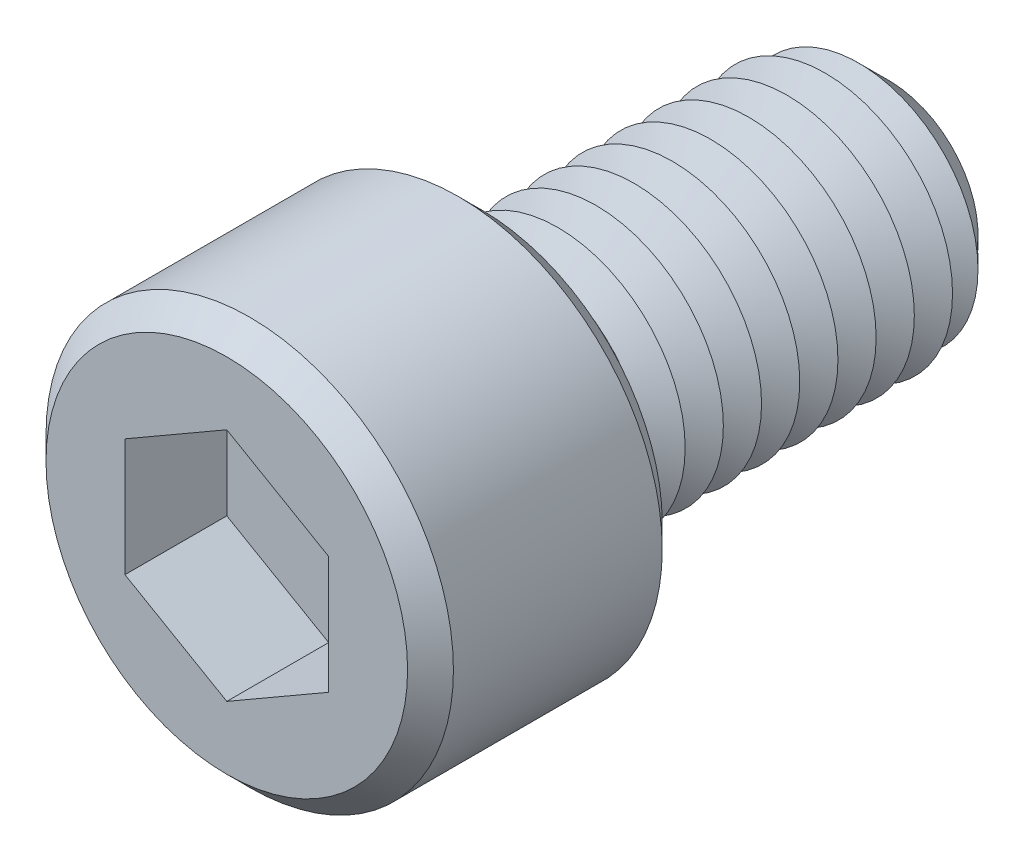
from build123d import *

# Parameters (mm, degrees)
SKETCH1_R           = 8
BOSS_EXTRUDE1_DEPTH = 10
SKETCH2_R           = 5
BOSS_EXTRUDE2_DEPTH = 16
CHAMFER1_SIZE       = 1.5
LPATTERN1_COUNT     = 10
LPATTERN1_PITCH     = 1.5
CUT_EXTRUDE1_DEPTH  = 4
SKETCH6_R           = 0.9
CUT_EXTRUDE2_DEPTH  = 22
CHAMFER2_SIZE       = 0.9


with BuildPart() as part:
    # Sketch1 → Boss-Extrude1 (new body)
    with BuildSketch(Plane.XY):
        Circle(SKETCH1_R)
    extrude(amount=BOSS_EXTRUDE1_DEPTH)

    # Sketch2 → Boss-Extrude2 (add)
    with BuildSketch(Plane(origin=(0, 0, 0), x_dir=(-1, 0, 0), z_dir=(0, 0, -1))):
        Circle(SKETCH2_R)
    extrude(amount=BOSS_EXTRUDE2_DEPTH)

    # Chamfer1
    chamfer1_edges = [part.edges().sort_by_distance(p)[0] for p in [
        (5, 0, -16),
    ]]
    chamfer(chamfer1_edges, length=CHAMFER1_SIZE)

    # Sketch4 → Cut-Revolve1 (revolve, cut)
    with BuildSketch(Plane(origin=(0, 0, 0), x_dir=(0, 0, -1), z_dir=(1, 0, 0)), mode=Mode.PRIVATE) as cut_revolve1_sk:
        Polygon((0, 5), (0.75, 3.700961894), (1.5, 5), align=None)
    cut_revolve1 = revolve(cut_revolve1_sk.sketch.rotate(Axis((0, 0, 2.512122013), (0, 0, -1)), 90), axis=Axis((0, 0, 2.512122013), (0, 0, -1)), mode=Mode.SUBTRACT)

    # LPattern1: Cut-Revolve1 ×10
    with Locations(*[(0, 0, -i * LPATTERN1_PITCH) for i in range(1, LPATTERN1_COUNT)]):
        add(cut_revolve1, mode=Mode.SUBTRACT)

    # Sketch5 → Cut-Extrude1 (cut)
    with BuildSketch(Plane.XY.offset(10)):
        Polygon((0, 4.618802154), (-4, 2.309401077), (-4, -2.309401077), (0, -4.618802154), (4, -2.309401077), (4, 2.309401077), align=None)
    extrude(amount=-CUT_EXTRUDE1_DEPTH, mode=Mode.SUBTRACT)

    # Sketch6 → Cut-Extrude2 (cut)
    with BuildSketch(Plane.XY.offset(6)):
        Circle(SKETCH6_R)
    extrude(amount=-CUT_EXTRUDE2_DEPTH, mode=Mode.SUBTRACT)

    # Chamfer2
    chamfer2_edges = [part.edges().sort_by_distance(p)[0] for p in [
        (-8, 0, 0),
        (-8, 0, 10),
    ]]
    chamfer(chamfer2_edges, length=CHAMFER2_SIZE)


solid = part.part
